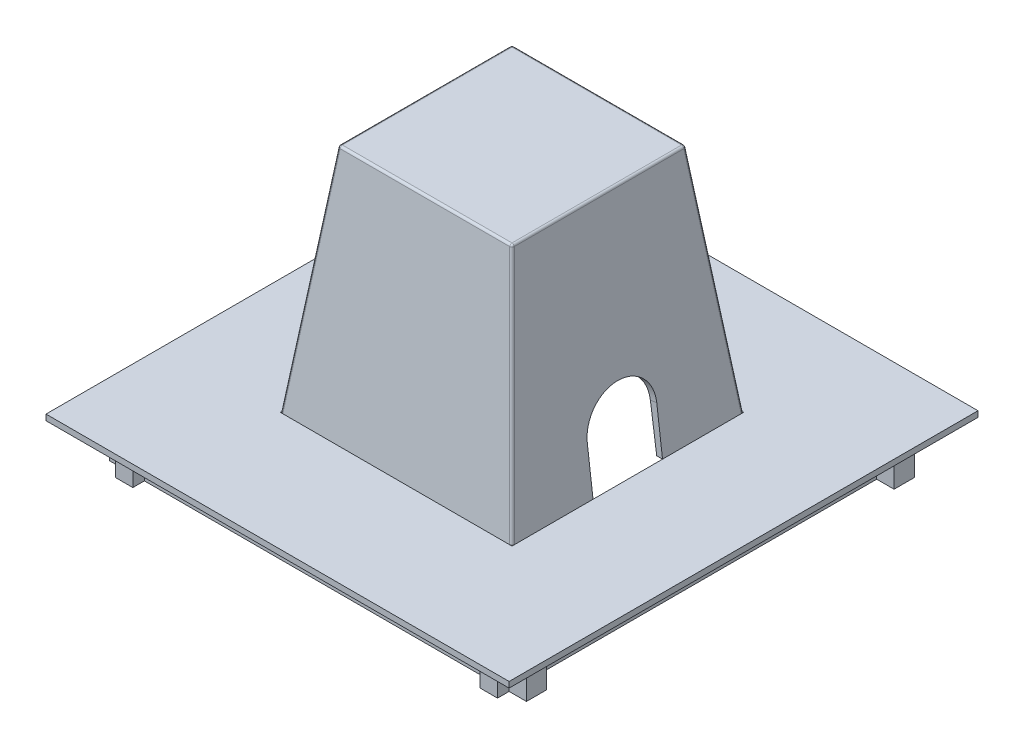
from build123d import *

# Parameters (mm, degrees)
SKETCH1_W           = 762
SKETCH1_H           = 762
BOSS_EXTRUDE1_DEPTH = 95.25
SKETCH2_W           = 1016
SKETCH2_H           = 1028.7
SKETCH2_W_2         = 508
SKETCH2_H_2         = 508
BOSS_EXTRUDE2_DEPTH = 12.7
FILLET1_R           = 5.08
SKETCH10_W          = 482.6
SKETCH10_H          = 482.6
CUT_EXTRUDE2_DEPTH  = 462.28
CUT_EXTRUDE2_DRAFT  = -8
CUT_EXTRUDE3_DEPTH  = 375.92


with BuildPart() as part:
    # Sketch1 → Boss-Extrude1 (new body)
    with BuildSketch(Plane(origin=(0, 0, 0), x_dir=(1, 0, 0), z_dir=(0, 1, 0))):
        Polygon((0, -914.4), (-38.1, -914.4), (-38.1, -889), (-800.1, -889), (-800.1, -914.4), (-838.2, -914.4), (-838.2, -889), (-876.3, -889), (-876.3, -844.55), (-838.2, -844.55), (-838.2, -82.55), (-876.3, -82.55), (-876.3, -38.1), (-838.2, -38.1), (-838.2, 0), (-800.1, 0), (-800.1, -38.1), (-38.1, -38.1), (-38.1, 0), (0, 0), (0, -38.1), (38.1, -38.1), (38.1, -82.55), (0, -82.55), (0, -844.55), (38.1, -844.55), (38.1, -889), (0, -889), align=None)
        with Locations((-419.1, -463.55)):
            Rectangle(SKETCH1_W, SKETCH1_H, mode=Mode.SUBTRACT)
    extrude(amount=BOSS_EXTRUDE1_DEPTH)

    # Sketch2 → Boss-Extrude2 (add)
    with BuildSketch(Plane(origin=(0, 95.25, 0), x_dir=(1, 0, 0), z_dir=(0, 1, 0))):
        with Locations((-419.1, -463.55)):
            Rectangle(SKETCH2_W, SKETCH2_H)
        with Locations((-419.1, -463.55)):
            Rectangle(SKETCH2_W_2, SKETCH2_H_2, mode=Mode.SUBTRACT)
    extrude(amount=BOSS_EXTRUDE2_DEPTH)


with BuildPart() as body_2:
    # Sketch4 → Loft1 section 0
    with BuildSketch(Plane(origin=(0, 107.95, 0), x_dir=(1, 0, 0), z_dir=(0, 1, 0))):
        with BuildLine():
            Line((-673.1, -717.55), (-165.1, -717.55))
            Line((-165.1, -717.55), (-165.1, -209.55))
            Line((-165.1, -209.55), (-673.1, -209.55))
            Line((-673.1, -209.55), (-673.1, -717.55))
        make_face()
    # Sketch7 → Loft1 section 1
    with BuildSketch(Plane(origin=(0, 615.95, 0), x_dir=(-1, 0, 0), z_dir=(0, -1, 0))):
        with BuildLine():
            Line((228.6, -654.05), (609.6, -654.05))
            Line((609.6, -654.05), (609.6, -273.05))
            Line((609.6, -273.05), (228.6, -273.05))
            Line((228.6, -273.05), (228.6, -654.05))
        make_face()
    loft()

    # Fillet1
    fillet1_edges = [body_2.edges().sort_by_distance(p)[0] for p in [
        (-196.85, 361.95, 241.3),
        (-641.35, 361.95, 241.3),
        (-196.85, 361.95, 685.8),
        (-641.35, 361.95, 685.8),
        (-228.6, 615.95, 463.55),
        (-419.1, 615.95, 654.05),
        (-609.6, 615.95, 463.55),
        (-419.1, 615.95, 273.05),
    ]]
    fillet(fillet1_edges, radius=FILLET1_R)


with BuildPart() as cut_extrude2_tool:
    # Sketch10 → Cut-Extrude2 (with draft: the straight prism first)
    with BuildSketch(Plane.XZ.offset(-107.95)):
        with Locations((-419.1, 463.55)):
            Rectangle(SKETCH10_W, SKETCH10_H)
    extrude(amount=-CUT_EXTRUDE2_DEPTH)
    # Cut-Extrude2: the draft: its side faces are tilted about the plane it starts from
    cut_extrude2_sides = [cut_extrude2_tool.faces().sort_by_distance(p)[0] for p in [
        (-177.8, 339.09, 463.55),
        (-419.1, 339.09, 704.85),
        (-660.4, 339.09, 463.55),
        (-419.1, 339.09, 222.25),
    ]]
    draft(cut_extrude2_sides, Plane.XZ.offset(-107.95), CUT_EXTRUDE2_DRAFT)


with BuildPart() as body_2_1:
    add(body_2.part)

    # Cut-Extrude2: cut by cut_extrude2_tool
    add(cut_extrude2_tool.part, mode=Mode.SUBTRACT)

    # Sketch8 → Cut-Extrude3 (cut)
    with BuildSketch(Plane(origin=(-149.273846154, -18.659230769, 0), x_dir=(0, 0, -1), z_dir=(0.9922778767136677, 0.12403473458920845, 0))):
        with BuildLine():
            Line((-539.75, 127.594531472), (-387.35, 127.594531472))
            Line((-387.35, 127.594531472), (-387.35, 229.194531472))
            ThreePointArc((-387.35, 229.194531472), (-463.55, 305.394531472), (-539.75, 229.194531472))
            Line((-539.75, 229.194531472), (-539.75, 127.594531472))
        make_face()
    extrude(amount=-CUT_EXTRUDE3_DEPTH, mode=Mode.SUBTRACT)


solid = Compound([part.part, body_2_1.part])
